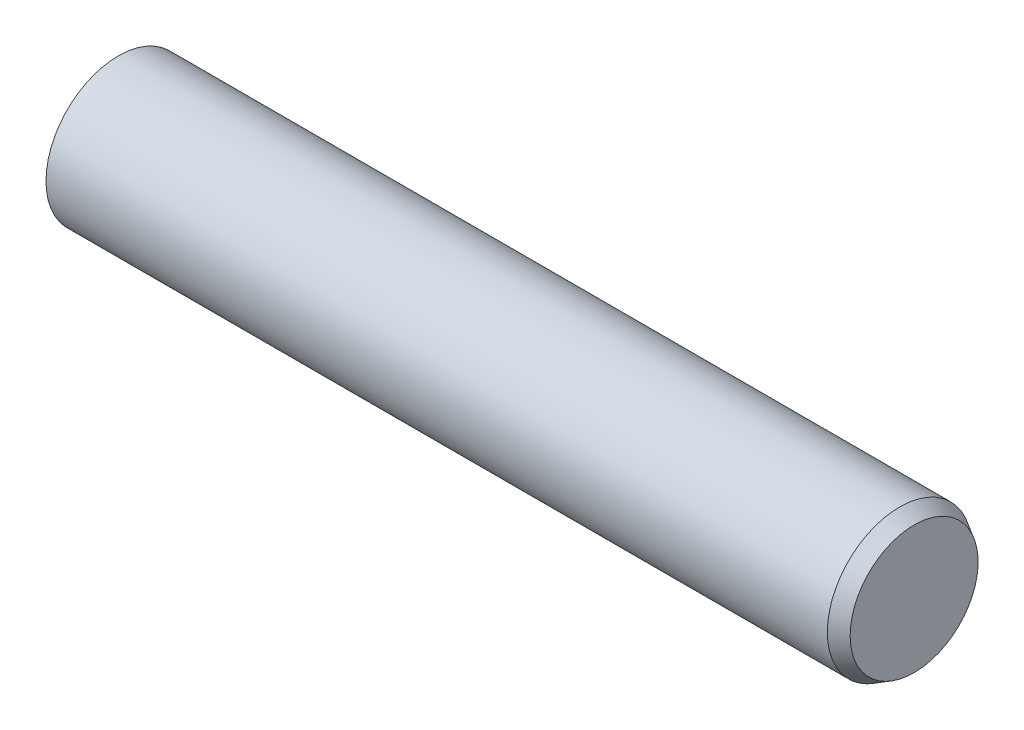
from build123d import *

# Parameters (mm, degrees)
CHANFREIN1_SIZE  = 3
CHANFREIN1_SIZE2 = 1.732050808


with BuildPart() as part:
    # Esquisse1 → R_volution1 (revolve)
    with BuildSketch(Plane.XY, mode=Mode.PRIVATE) as r_volution1_sk:
        Polygon((0, 0), (0, 7.5), (3, 7.5), (3, 15), (168, 15), (168, 0), align=None)
    revolve(r_volution1_sk.sketch.rotate(Axis((0, 0, 0), (1, 0, 0)), 90), axis=Axis((0, 0, 0), (1, 0, 0)))

    # Chanfrein1
    chanfrein1_edges = [part.edges().sort_by_distance(p)[0] for p in [
        (168, 0, -15),
    ]]
    chanfrein1_side = [part.faces().sort_by_distance(p)[0] for p in [
        (85.5, 0, -15),
    ]]
    chamfer(chanfrein1_edges, length=CHANFREIN1_SIZE, length2=CHANFREIN1_SIZE2, reference=chanfrein1_side[0])


solid = part.part
